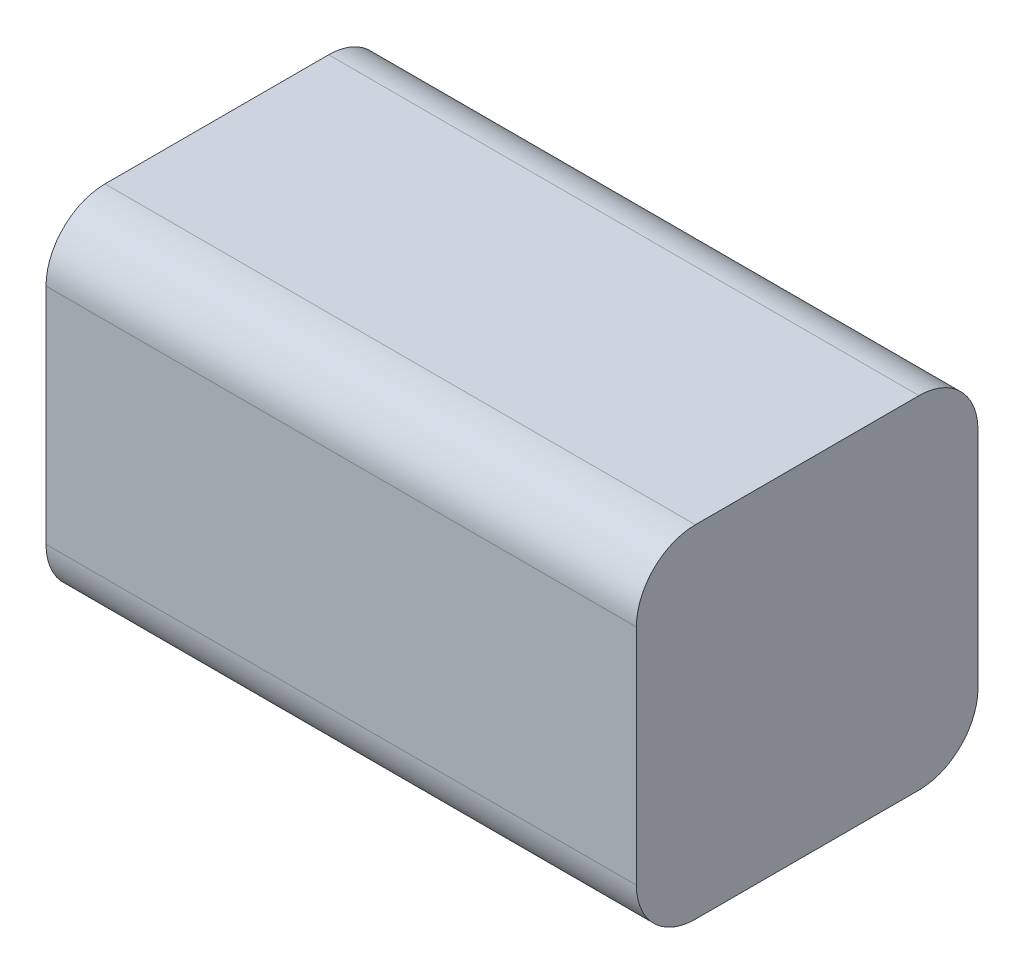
ISO-10303-21;
HEADER;
FILE_DESCRIPTION(('STEP AP214'),'2;1');
FILE_NAME('part.step','',(''),(''),'','','');
FILE_SCHEMA(('AUTOMOTIVE_DESIGN { 1 0 10303 214 1 1 1 1 }'));
ENDSEC;
DATA;
#1=APPLICATION_CONTEXT('core data for automotive mechanical design processes');
#2=APPLICATION_PROTOCOL_DEFINITION('international standard','automotive_design',2000,#1);
#3=PRODUCT_CONTEXT('',#1,'mechanical');
#4=PRODUCT('Part','Part','',(#3));
#5=PRODUCT_RELATED_PRODUCT_CATEGORY('part','',(#4));
#6=PRODUCT_DEFINITION_FORMATION('','',#4);
#7=PRODUCT_DEFINITION_CONTEXT('part definition',#1,'design');
#8=PRODUCT_DEFINITION('design','',#6,#7);
#9=PRODUCT_DEFINITION_SHAPE('','',#8);
#10=(LENGTH_UNIT() NAMED_UNIT(*) SI_UNIT(.MILLI.,.METRE.));
#11=(NAMED_UNIT(*) PLANE_ANGLE_UNIT() SI_UNIT($,.RADIAN.));
#12=(NAMED_UNIT(*) SI_UNIT($,.STERADIAN.) SOLID_ANGLE_UNIT());
#13=UNCERTAINTY_MEASURE_WITH_UNIT(LENGTH_MEASURE(1.E-05),#10,'distance_accuracy_value','');
#14=(GEOMETRIC_REPRESENTATION_CONTEXT(3) GLOBAL_UNCERTAINTY_ASSIGNED_CONTEXT((#13)) GLOBAL_UNIT_ASSIGNED_CONTEXT((#10,
#11,#12)) REPRESENTATION_CONTEXT('',''));
#15=CARTESIAN_POINT('',(0.,0.,0.));
#16=DIRECTION('',(0.,0.,1.));
#17=DIRECTION('',(1.,0.,0.));
#18=AXIS2_PLACEMENT_3D('',#15,#16,#17);
#19=CARTESIAN_POINT('',(0.,28.956,0.));
#20=DIRECTION('',(-1.,0.,0.));
#21=DIRECTION('',(0.,0.,1.));
#22=AXIS2_PLACEMENT_3D('',#19,#20,#21);
#23=PLANE('',#22);
#24=DIRECTION('',(0.,-1.,0.));
#25=VECTOR('',#24,1.);
#26=CARTESIAN_POINT('',(0.,28.956,28.956));
#27=LINE('',#26,#25);
#28=CARTESIAN_POINT('',(0.,23.956,28.956));
#29=VERTEX_POINT('',#28);
#30=CARTESIAN_POINT('',(0.,5.,28.956));
#31=VERTEX_POINT('',#30);
#32=EDGE_CURVE('E106',#29,#31,#27,.T.);
#33=ORIENTED_EDGE('',*,*,#32,.T.);
#34=CARTESIAN_POINT('',(0.,5.,23.956));
#35=DIRECTION('',(-1.,0.,0.));
#36=DIRECTION('',(0.,0.,1.));
#37=AXIS2_PLACEMENT_3D('',#34,#35,#36);
#38=CIRCLE('',#37,5.);
#39=CARTESIAN_POINT('',(0.,0.,23.956));
#40=VERTEX_POINT('',#39);
#41=EDGE_CURVE('E139',#31,#40,#38,.F.);
#42=ORIENTED_EDGE('',*,*,#41,.T.);
#43=DIRECTION('',(0.,0.,-1.));
#44=VECTOR('',#43,1.);
#45=CARTESIAN_POINT('',(0.,0.,0.));
#46=LINE('',#45,#44);
#47=CARTESIAN_POINT('',(0.,0.,5.));
#48=VERTEX_POINT('',#47);
#49=EDGE_CURVE('E161',#40,#48,#46,.T.);
#50=ORIENTED_EDGE('',*,*,#49,.T.);
#51=CARTESIAN_POINT('',(0.,5.,5.));
#52=DIRECTION('',(-1.,0.,0.));
#53=DIRECTION('',(0.,0.,1.));
#54=AXIS2_PLACEMENT_3D('',#51,#52,#53);
#55=CIRCLE('',#54,5.);
#56=CARTESIAN_POINT('',(0.,5.,0.));
#57=VERTEX_POINT('',#56);
#58=EDGE_CURVE('E137',#48,#57,#55,.F.);
#59=ORIENTED_EDGE('',*,*,#58,.T.);
#60=DIRECTION('',(0.,-1.,0.));
#61=VECTOR('',#60,1.);
#62=CARTESIAN_POINT('',(0.,28.956,0.));
#63=LINE('',#62,#61);
#64=CARTESIAN_POINT('',(0.,23.956,0.));
#65=VERTEX_POINT('',#64);
#66=EDGE_CURVE('E128',#65,#57,#63,.T.);
#67=ORIENTED_EDGE('',*,*,#66,.F.);
#68=CARTESIAN_POINT('',(0.,23.956,5.));
#69=DIRECTION('',(-1.,0.,0.));
#70=DIRECTION('',(0.,0.,1.));
#71=AXIS2_PLACEMENT_3D('',#68,#69,#70);
#72=CIRCLE('',#71,5.);
#73=CARTESIAN_POINT('',(0.,28.956,5.));
#74=VERTEX_POINT('',#73);
#75=EDGE_CURVE('E113',#65,#74,#72,.F.);
#76=ORIENTED_EDGE('',*,*,#75,.T.);
#77=DIRECTION('',(0.,0.,-1.));
#78=VECTOR('',#77,1.);
#79=CARTESIAN_POINT('',(0.,28.956,0.));
#80=LINE('',#79,#78);
#81=CARTESIAN_POINT('',(0.,28.956,23.956));
#82=VERTEX_POINT('',#81);
#83=EDGE_CURVE('E108',#82,#74,#80,.T.);
#84=ORIENTED_EDGE('',*,*,#83,.F.);
#85=CARTESIAN_POINT('',(0.,23.956,23.956));
#86=DIRECTION('',(-1.,0.,0.));
#87=DIRECTION('',(0.,0.,1.));
#88=AXIS2_PLACEMENT_3D('',#85,#86,#87);
#89=CIRCLE('',#88,5.);
#90=EDGE_CURVE('E104',#82,#29,#89,.F.);
#91=ORIENTED_EDGE('',*,*,#90,.T.);
#92=EDGE_LOOP('',(#33,#42,#50,#59,#67,#76,#84,#91));
#93=FACE_BOUND('',#92,.T.);
#94=ADVANCED_FACE('F37',(#93),#23,.F.);
#95=CARTESIAN_POINT('',(0.,28.956,0.));
#96=DIRECTION('',(0.,0.,1.));
#97=DIRECTION('',(1.,0.,0.));
#98=AXIS2_PLACEMENT_3D('',#95,#96,#97);
#99=PLANE('',#98);
#100=ORIENTED_EDGE('',*,*,#66,.T.);
#101=DIRECTION('',(-1.,0.,0.));
#102=VECTOR('',#101,1.);
#103=CARTESIAN_POINT('',(-50.038,5.,0.));
#104=LINE('',#103,#102);
#105=CARTESIAN_POINT('',(-50.038,5.,0.));
#106=VERTEX_POINT('',#105);
#107=EDGE_CURVE('E152',#57,#106,#104,.T.);
#108=ORIENTED_EDGE('',*,*,#107,.T.);
#109=DIRECTION('',(0.,-1.,0.));
#110=VECTOR('',#109,1.);
#111=CARTESIAN_POINT('',(-50.038,28.956,0.));
#112=LINE('',#111,#110);
#113=CARTESIAN_POINT('',(-50.038,23.956,0.));
#114=VERTEX_POINT('',#113);
#115=EDGE_CURVE('E132',#114,#106,#112,.T.);
#116=ORIENTED_EDGE('',*,*,#115,.F.);
#117=DIRECTION('',(-1.,0.,0.));
#118=VECTOR('',#117,1.);
#119=CARTESIAN_POINT('',(0.,23.956,0.));
#120=LINE('',#119,#118);
#121=EDGE_CURVE('E150',#114,#65,#120,.F.);
#122=ORIENTED_EDGE('',*,*,#121,.T.);
#123=EDGE_LOOP('',(#100,#108,#116,#122));
#124=FACE_BOUND('',#123,.T.);
#125=ADVANCED_FACE('F170',(#124),#99,.F.);
#126=CARTESIAN_POINT('',(-50.038,28.956,0.));
#127=DIRECTION('',(1.,0.,0.));
#128=DIRECTION('',(0.,0.,-1.));
#129=AXIS2_PLACEMENT_3D('',#126,#127,#128);
#130=PLANE('',#129);
#131=DIRECTION('',(0.,0.,1.));
#132=VECTOR('',#131,1.);
#133=CARTESIAN_POINT('',(-50.038,0.,0.));
#134=LINE('',#133,#132);
#135=CARTESIAN_POINT('',(-50.038,0.,5.));
#136=VERTEX_POINT('',#135);
#137=CARTESIAN_POINT('',(-50.038,0.,23.956));
#138=VERTEX_POINT('',#137);
#139=EDGE_CURVE('E158',#136,#138,#134,.T.);
#140=ORIENTED_EDGE('',*,*,#139,.T.);
#141=CARTESIAN_POINT('',(-50.038,5.,23.956));
#142=DIRECTION('',(1.,0.,0.));
#143=DIRECTION('',(0.,0.,-1.));
#144=AXIS2_PLACEMENT_3D('',#141,#142,#143);
#145=CIRCLE('',#144,5.);
#146=CARTESIAN_POINT('',(-50.038,5.,28.956));
#147=VERTEX_POINT('',#146);
#148=EDGE_CURVE('E148',#138,#147,#145,.F.);
#149=ORIENTED_EDGE('',*,*,#148,.T.);
#150=DIRECTION('',(0.,-1.,0.));
#151=VECTOR('',#150,1.);
#152=CARTESIAN_POINT('',(-50.038,28.956,28.956));
#153=LINE('',#152,#151);
#154=CARTESIAN_POINT('',(-50.038,23.956,28.956));
#155=VERTEX_POINT('',#154);
#156=EDGE_CURVE('E123',#155,#147,#153,.T.);
#157=ORIENTED_EDGE('',*,*,#156,.F.);
#158=CARTESIAN_POINT('',(-50.038,23.956,23.956));
#159=DIRECTION('',(1.,0.,0.));
#160=DIRECTION('',(0.,0.,-1.));
#161=AXIS2_PLACEMENT_3D('',#158,#159,#160);
#162=CIRCLE('',#161,5.);
#163=CARTESIAN_POINT('',(-50.038,28.956,23.956));
#164=VERTEX_POINT('',#163);
#165=EDGE_CURVE('E127',#155,#164,#162,.F.);
#166=ORIENTED_EDGE('',*,*,#165,.T.);
#167=DIRECTION('',(0.,0.,1.));
#168=VECTOR('',#167,1.);
#169=CARTESIAN_POINT('',(-50.038,28.956,0.));
#170=LINE('',#169,#168);
#171=CARTESIAN_POINT('',(-50.038,28.956,5.));
#172=VERTEX_POINT('',#171);
#173=EDGE_CURVE('E124',#172,#164,#170,.T.);
#174=ORIENTED_EDGE('',*,*,#173,.F.);
#175=CARTESIAN_POINT('',(-50.038,23.956,5.));
#176=DIRECTION('',(1.,0.,0.));
#177=DIRECTION('',(0.,0.,-1.));
#178=AXIS2_PLACEMENT_3D('',#175,#176,#177);
#179=CIRCLE('',#178,5.);
#180=EDGE_CURVE('E60',#172,#114,#179,.F.);
#181=ORIENTED_EDGE('',*,*,#180,.T.);
#182=ORIENTED_EDGE('',*,*,#115,.T.);
#183=CARTESIAN_POINT('',(-50.038,5.,5.));
#184=DIRECTION('',(1.,0.,0.));
#185=DIRECTION('',(0.,0.,-1.));
#186=AXIS2_PLACEMENT_3D('',#183,#184,#185);
#187=CIRCLE('',#186,5.);
#188=EDGE_CURVE('E52',#106,#136,#187,.F.);
#189=ORIENTED_EDGE('',*,*,#188,.T.);
#190=EDGE_LOOP('',(#140,#149,#157,#166,#174,#181,#182,#189));
#191=FACE_BOUND('',#190,.T.);
#192=ADVANCED_FACE('F166',(#191),#130,.F.);
#193=CARTESIAN_POINT('',(0.,28.956,28.956));
#194=DIRECTION('',(0.,0.,-1.));
#195=DIRECTION('',(-1.,0.,0.));
#196=AXIS2_PLACEMENT_3D('',#193,#194,#195);
#197=PLANE('',#196);
#198=ORIENTED_EDGE('',*,*,#156,.T.);
#199=DIRECTION('',(1.,0.,0.));
#200=VECTOR('',#199,1.);
#201=CARTESIAN_POINT('',(0.,5.,28.956));
#202=LINE('',#201,#200);
#203=EDGE_CURVE('E114',#147,#31,#202,.T.);
#204=ORIENTED_EDGE('',*,*,#203,.T.);
#205=ORIENTED_EDGE('',*,*,#32,.F.);
#206=DIRECTION('',(1.,0.,0.));
#207=VECTOR('',#206,1.);
#208=CARTESIAN_POINT('',(0.,23.956,28.956));
#209=LINE('',#208,#207);
#210=EDGE_CURVE('E120',#29,#155,#209,.F.);
#211=ORIENTED_EDGE('',*,*,#210,.T.);
#212=EDGE_LOOP('',(#198,#204,#205,#211));
#213=FACE_BOUND('',#212,.T.);
#214=ADVANCED_FACE('F119',(#213),#197,.F.);
#215=CARTESIAN_POINT('',(0.,28.956,0.));
#216=DIRECTION('',(0.,-1.,0.));
#217=DIRECTION('',(0.,0.,-1.));
#218=AXIS2_PLACEMENT_3D('',#215,#216,#217);
#219=PLANE('',#218);
#220=ORIENTED_EDGE('',*,*,#83,.T.);
#221=DIRECTION('',(-1.,0.,0.));
#222=VECTOR('',#221,1.);
#223=CARTESIAN_POINT('',(0.,28.956,5.));
#224=LINE('',#223,#222);
#225=EDGE_CURVE('E11',#74,#172,#224,.T.);
#226=ORIENTED_EDGE('',*,*,#225,.T.);
#227=ORIENTED_EDGE('',*,*,#173,.T.);
#228=DIRECTION('',(1.,0.,0.));
#229=VECTOR('',#228,1.);
#230=CARTESIAN_POINT('',(0.,28.956,23.956));
#231=LINE('',#230,#229);
#232=EDGE_CURVE('E45',#164,#82,#231,.T.);
#233=ORIENTED_EDGE('',*,*,#232,.T.);
#234=EDGE_LOOP('',(#220,#226,#227,#233));
#235=FACE_BOUND('',#234,.T.);
#236=ADVANCED_FACE('F155',(#235),#219,.F.);
#237=CARTESIAN_POINT('',(0.,0.,0.));
#238=DIRECTION('',(0.,-1.,0.));
#239=DIRECTION('',(0.,0.,-1.));
#240=AXIS2_PLACEMENT_3D('',#237,#238,#239);
#241=PLANE('',#240);
#242=ORIENTED_EDGE('',*,*,#49,.F.);
#243=DIRECTION('',(1.,0.,0.));
#244=VECTOR('',#243,1.);
#245=CARTESIAN_POINT('',(-50.038,0.,23.956));
#246=LINE('',#245,#244);
#247=EDGE_CURVE('E143',#40,#138,#246,.F.);
#248=ORIENTED_EDGE('',*,*,#247,.T.);
#249=ORIENTED_EDGE('',*,*,#139,.F.);
#250=DIRECTION('',(-1.,0.,0.));
#251=VECTOR('',#250,1.);
#252=CARTESIAN_POINT('',(0.,0.,5.));
#253=LINE('',#252,#251);
#254=EDGE_CURVE('E141',#136,#48,#253,.F.);
#255=ORIENTED_EDGE('',*,*,#254,.T.);
#256=EDGE_LOOP('',(#242,#248,#249,#255));
#257=FACE_BOUND('',#256,.T.);
#258=ADVANCED_FACE('F179',(#257),#241,.T.);
#259=CARTESIAN_POINT('',(0.,5.,23.956));
#260=DIRECTION('',(-1.,0.,0.));
#261=DIRECTION('',(0.,0.,1.));
#262=AXIS2_PLACEMENT_3D('',#259,#260,#261);
#263=CYLINDRICAL_SURFACE('',#262,5.);
#264=ORIENTED_EDGE('',*,*,#148,.F.);
#265=ORIENTED_EDGE('',*,*,#247,.F.);
#266=ORIENTED_EDGE('',*,*,#41,.F.);
#267=ORIENTED_EDGE('',*,*,#203,.F.);
#268=EDGE_LOOP('',(#264,#265,#266,#267));
#269=FACE_BOUND('',#268,.T.);
#270=ADVANCED_FACE('F183',(#269),#263,.T.);
#271=CARTESIAN_POINT('',(0.,5.,5.));
#272=DIRECTION('',(1.,0.,0.));
#273=DIRECTION('',(0.,0.,-1.));
#274=AXIS2_PLACEMENT_3D('',#271,#272,#273);
#275=CYLINDRICAL_SURFACE('',#274,5.);
#276=ORIENTED_EDGE('',*,*,#58,.F.);
#277=ORIENTED_EDGE('',*,*,#254,.F.);
#278=ORIENTED_EDGE('',*,*,#188,.F.);
#279=ORIENTED_EDGE('',*,*,#107,.F.);
#280=EDGE_LOOP('',(#276,#277,#278,#279));
#281=FACE_BOUND('',#280,.T.);
#282=ADVANCED_FACE('F176',(#281),#275,.T.);
#283=CARTESIAN_POINT('',(0.,23.956,5.));
#284=DIRECTION('',(-1.,0.,0.));
#285=DIRECTION('',(0.,0.,1.));
#286=AXIS2_PLACEMENT_3D('',#283,#284,#285);
#287=CYLINDRICAL_SURFACE('',#286,5.);
#288=ORIENTED_EDGE('',*,*,#75,.F.);
#289=ORIENTED_EDGE('',*,*,#121,.F.);
#290=ORIENTED_EDGE('',*,*,#180,.F.);
#291=ORIENTED_EDGE('',*,*,#225,.F.);
#292=EDGE_LOOP('',(#288,#289,#290,#291));
#293=FACE_BOUND('',#292,.T.);
#294=ADVANCED_FACE('F174',(#293),#287,.T.);
#295=CARTESIAN_POINT('',(0.,23.956,23.956));
#296=DIRECTION('',(1.,0.,0.));
#297=DIRECTION('',(0.,0.,-1.));
#298=AXIS2_PLACEMENT_3D('',#295,#296,#297);
#299=CYLINDRICAL_SURFACE('',#298,5.);
#300=ORIENTED_EDGE('',*,*,#165,.F.);
#301=ORIENTED_EDGE('',*,*,#210,.F.);
#302=ORIENTED_EDGE('',*,*,#90,.F.);
#303=ORIENTED_EDGE('',*,*,#232,.F.);
#304=EDGE_LOOP('',(#300,#301,#302,#303));
#305=FACE_BOUND('',#304,.T.);
#306=ADVANCED_FACE('F39',(#305),#299,.T.);
#307=CLOSED_SHELL('',(#94,#125,#192,#214,#236,#258,#270,#282,#294,#306));
#308=MANIFOLD_SOLID_BREP('B2',#307);
#309=ADVANCED_BREP_SHAPE_REPRESENTATION('',(#18,#308),#14);
#310=SHAPE_DEFINITION_REPRESENTATION(#9,#309);
ENDSEC;
END-ISO-10303-21;
